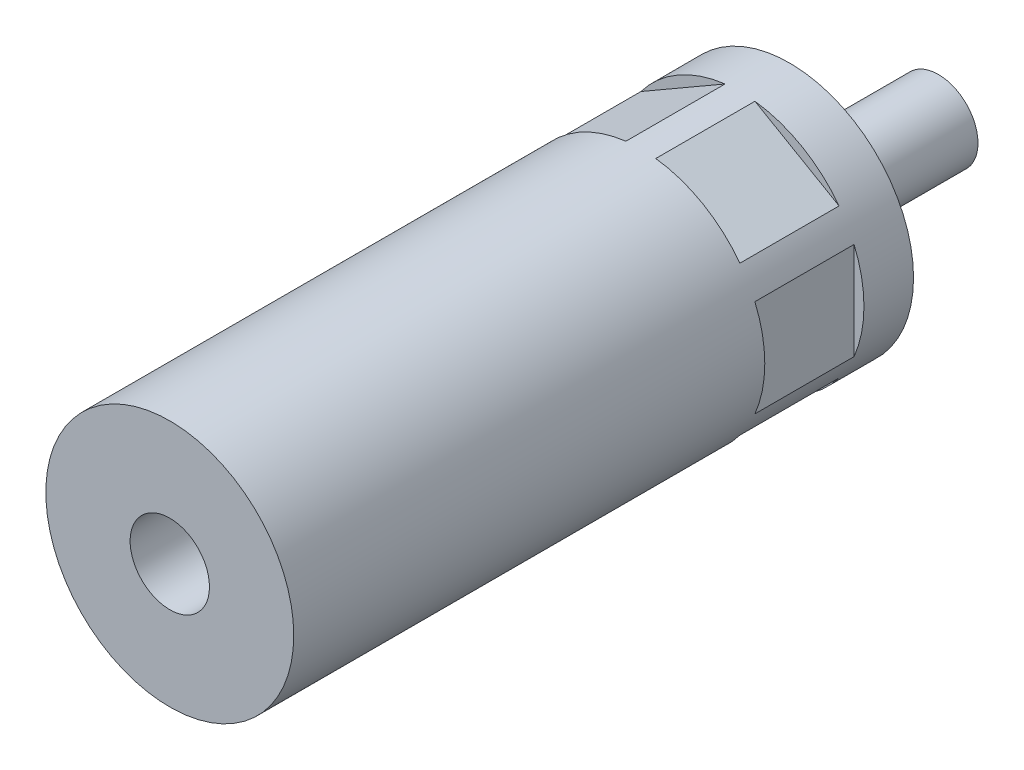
ISO-10303-21;
HEADER;
FILE_DESCRIPTION(('STEP AP214'),'2;1');
FILE_NAME('part.step','',(''),(''),'','','');
FILE_SCHEMA(('AUTOMOTIVE_DESIGN { 1 0 10303 214 1 1 1 1 }'));
ENDSEC;
DATA;
#1=APPLICATION_CONTEXT('core data for automotive mechanical design processes');
#2=APPLICATION_PROTOCOL_DEFINITION('international standard','automotive_design',2000,#1);
#3=PRODUCT_CONTEXT('',#1,'mechanical');
#4=PRODUCT('Part','Part','',(#3));
#5=PRODUCT_RELATED_PRODUCT_CATEGORY('part','',(#4));
#6=PRODUCT_DEFINITION_FORMATION('','',#4);
#7=PRODUCT_DEFINITION_CONTEXT('part definition',#1,'design');
#8=PRODUCT_DEFINITION('design','',#6,#7);
#9=PRODUCT_DEFINITION_SHAPE('','',#8);
#10=(LENGTH_UNIT() NAMED_UNIT(*) SI_UNIT(.MILLI.,.METRE.));
#11=(NAMED_UNIT(*) PLANE_ANGLE_UNIT() SI_UNIT($,.RADIAN.));
#12=(NAMED_UNIT(*) SI_UNIT($,.STERADIAN.) SOLID_ANGLE_UNIT());
#13=UNCERTAINTY_MEASURE_WITH_UNIT(LENGTH_MEASURE(1.E-05),#10,'distance_accuracy_value','');
#14=(GEOMETRIC_REPRESENTATION_CONTEXT(3) GLOBAL_UNCERTAINTY_ASSIGNED_CONTEXT((#13)) GLOBAL_UNIT_ASSIGNED_CONTEXT((#10,
#11,#12)) REPRESENTATION_CONTEXT('',''));
#15=CARTESIAN_POINT('',(0.,0.,0.));
#16=DIRECTION('',(0.,0.,1.));
#17=DIRECTION('',(1.,0.,0.));
#18=AXIS2_PLACEMENT_3D('',#15,#16,#17);
#19=CARTESIAN_POINT('',(0.,0.,80.));
#20=DIRECTION('',(0.,0.,1.));
#21=DIRECTION('',(1.,0.,0.));
#22=AXIS2_PLACEMENT_3D('',#19,#20,#21);
#23=CYLINDRICAL_SURFACE('',#22,25.);
#24=CARTESIAN_POINT('',(0.,0.,10.));
#25=DIRECTION('',(0.,0.,1.));
#26=DIRECTION('',(1.,0.,0.));
#27=AXIS2_PLACEMENT_3D('',#24,#25,#26);
#28=CIRCLE('',#27,25.);
#29=CARTESIAN_POINT('',(-19.9852813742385,-15.0196048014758,10.));
#30=VERTEX_POINT('',#29);
#31=CARTESIAN_POINT('',(-3.0147186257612,-24.8175637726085,10.));
#32=VERTEX_POINT('',#31);
#33=EDGE_CURVE('E152',#30,#32,#28,.T.);
#34=ORIENTED_EDGE('',*,*,#33,.F.);
#35=DIRECTION('',(0.,0.,1.));
#36=VECTOR('',#35,1.);
#37=CARTESIAN_POINT('',(-19.9852813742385,-15.0196048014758,80.));
#38=LINE('',#37,#36);
#39=CARTESIAN_POINT('',(-19.9852813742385,-15.0196048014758,30.));
#40=VERTEX_POINT('',#39);
#41=EDGE_CURVE('E9',#30,#40,#38,.T.);
#42=ORIENTED_EDGE('',*,*,#41,.T.);
#43=CARTESIAN_POINT('',(0.,0.,30.));
#44=DIRECTION('',(0.,0.,1.));
#45=DIRECTION('',(1.,0.,0.));
#46=AXIS2_PLACEMENT_3D('',#43,#44,#45);
#47=CIRCLE('',#46,25.);
#48=CARTESIAN_POINT('',(-3.0147186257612,-24.8175637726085,30.));
#49=VERTEX_POINT('',#48);
#50=EDGE_CURVE('E22',#40,#49,#47,.T.);
#51=ORIENTED_EDGE('',*,*,#50,.T.);
#52=DIRECTION('',(0.,0.,1.));
#53=VECTOR('',#52,1.);
#54=CARTESIAN_POINT('',(-3.0147186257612,-24.8175637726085,80.));
#55=LINE('',#54,#53);
#56=EDGE_CURVE('E149',#49,#32,#55,.F.);
#57=ORIENTED_EDGE('',*,*,#56,.T.);
#58=EDGE_LOOP('',(#34,#42,#51,#57));
#59=FACE_BOUND('',#58,.T.);
#60=DIRECTION('',(0.,0.,1.));
#61=VECTOR('',#60,1.);
#62=CARTESIAN_POINT('',(23.,9.79795897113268,80.));
#63=LINE('',#62,#61);
#64=CARTESIAN_POINT('',(23.,9.79795897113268,10.));
#65=VERTEX_POINT('',#64);
#66=CARTESIAN_POINT('',(23.,9.79795897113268,30.));
#67=VERTEX_POINT('',#66);
#68=EDGE_CURVE('E142',#65,#67,#63,.T.);
#69=ORIENTED_EDGE('',*,*,#68,.F.);
#70=CARTESIAN_POINT('',(23.,-9.7979589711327,10.));
#71=VERTEX_POINT('',#70);
#72=EDGE_CURVE('E141',#71,#65,#28,.T.);
#73=ORIENTED_EDGE('',*,*,#72,.F.);
#74=DIRECTION('',(0.,0.,1.));
#75=VECTOR('',#74,1.);
#76=CARTESIAN_POINT('',(23.,-9.7979589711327,80.));
#77=LINE('',#76,#75);
#78=CARTESIAN_POINT('',(23.,-9.7979589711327,30.));
#79=VERTEX_POINT('',#78);
#80=EDGE_CURVE('E138',#79,#71,#77,.F.);
#81=ORIENTED_EDGE('',*,*,#80,.F.);
#82=EDGE_CURVE('E145',#79,#67,#47,.T.);
#83=ORIENTED_EDGE('',*,*,#82,.T.);
#84=EDGE_LOOP('',(#69,#73,#81,#83));
#85=FACE_BOUND('',#84,.T.);
#86=CARTESIAN_POINT('',(19.9852813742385,15.0196048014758,10.));
#87=VERTEX_POINT('',#86);
#88=CARTESIAN_POINT('',(3.0147186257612,24.8175637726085,10.));
#89=VERTEX_POINT('',#88);
#90=EDGE_CURVE('E134',#87,#89,#28,.T.);
#91=ORIENTED_EDGE('',*,*,#90,.F.);
#92=DIRECTION('',(0.,0.,1.));
#93=VECTOR('',#92,1.);
#94=CARTESIAN_POINT('',(19.9852813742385,15.0196048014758,80.));
#95=LINE('',#94,#93);
#96=CARTESIAN_POINT('',(19.9852813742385,15.0196048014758,30.));
#97=VERTEX_POINT('',#96);
#98=EDGE_CURVE('E135',#87,#97,#95,.T.);
#99=ORIENTED_EDGE('',*,*,#98,.T.);
#100=CARTESIAN_POINT('',(3.0147186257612,24.8175637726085,30.));
#101=VERTEX_POINT('',#100);
#102=EDGE_CURVE('E139',#97,#101,#47,.T.);
#103=ORIENTED_EDGE('',*,*,#102,.T.);
#104=DIRECTION('',(0.,0.,1.));
#105=VECTOR('',#104,1.);
#106=CARTESIAN_POINT('',(3.0147186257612,24.8175637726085,80.));
#107=LINE('',#106,#105);
#108=EDGE_CURVE('E131',#101,#89,#107,.F.);
#109=ORIENTED_EDGE('',*,*,#108,.T.);
#110=EDGE_LOOP('',(#91,#99,#103,#109));
#111=FACE_BOUND('',#110,.T.);
#112=CARTESIAN_POINT('',(0.,0.,0.));
#113=DIRECTION('',(0.,0.,1.));
#114=DIRECTION('',(1.,0.,0.));
#115=AXIS2_PLACEMENT_3D('',#112,#113,#114);
#116=CIRCLE('',#115,25.);
#117=CARTESIAN_POINT('',(25.,0.,0.));
#118=VERTEX_POINT('',#117);
#119=EDGE_CURVE('E210',#118,#118,#116,.T.);
#120=ORIENTED_EDGE('',*,*,#119,.T.);
#121=EDGE_LOOP('',(#120));
#122=FACE_BOUND('',#121,.T.);
#123=CARTESIAN_POINT('',(0.,0.,125.));
#124=DIRECTION('',(0.,0.,1.));
#125=DIRECTION('',(1.,0.,0.));
#126=AXIS2_PLACEMENT_3D('',#123,#124,#125);
#127=CIRCLE('',#126,25.);
#128=CARTESIAN_POINT('',(25.,0.,125.));
#129=VERTEX_POINT('',#128);
#130=EDGE_CURVE('E213',#129,#129,#127,.T.);
#131=ORIENTED_EDGE('',*,*,#130,.F.);
#132=EDGE_LOOP('',(#131));
#133=FACE_BOUND('',#132,.T.);
#134=CARTESIAN_POINT('',(-23.,9.79795897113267,10.));
#135=VERTEX_POINT('',#134);
#136=CARTESIAN_POINT('',(-23.,-9.79795897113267,10.));
#137=VERTEX_POINT('',#136);
#138=EDGE_CURVE('E111',#135,#137,#28,.T.);
#139=ORIENTED_EDGE('',*,*,#138,.F.);
#140=DIRECTION('',(0.,0.,1.));
#141=VECTOR('',#140,1.);
#142=CARTESIAN_POINT('',(-23.,9.79795897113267,80.));
#143=LINE('',#142,#141);
#144=CARTESIAN_POINT('',(-23.,9.79795897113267,30.));
#145=VERTEX_POINT('',#144);
#146=EDGE_CURVE('E110',#135,#145,#143,.T.);
#147=ORIENTED_EDGE('',*,*,#146,.T.);
#148=CARTESIAN_POINT('',(-23.,-9.79795897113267,30.));
#149=VERTEX_POINT('',#148);
#150=EDGE_CURVE('E103',#145,#149,#47,.T.);
#151=ORIENTED_EDGE('',*,*,#150,.T.);
#152=DIRECTION('',(0.,0.,1.));
#153=VECTOR('',#152,1.);
#154=CARTESIAN_POINT('',(-23.,-9.79795897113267,80.));
#155=LINE('',#154,#153);
#156=EDGE_CURVE('E117',#149,#137,#155,.F.);
#157=ORIENTED_EDGE('',*,*,#156,.T.);
#158=EDGE_LOOP('',(#139,#147,#151,#157));
#159=FACE_BOUND('',#158,.T.);
#160=DIRECTION('',(0.,0.,1.));
#161=VECTOR('',#160,1.);
#162=CARTESIAN_POINT('',(-19.9852813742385,15.0196048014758,80.));
#163=LINE('',#162,#161);
#164=CARTESIAN_POINT('',(-19.9852813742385,15.0196048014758,10.));
#165=VERTEX_POINT('',#164);
#166=CARTESIAN_POINT('',(-19.9852813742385,15.0196048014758,30.));
#167=VERTEX_POINT('',#166);
#168=EDGE_CURVE('E129',#165,#167,#163,.T.);
#169=ORIENTED_EDGE('',*,*,#168,.F.);
#170=CARTESIAN_POINT('',(-3.0147186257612,24.8175637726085,10.));
#171=VERTEX_POINT('',#170);
#172=EDGE_CURVE('E125',#171,#165,#28,.T.);
#173=ORIENTED_EDGE('',*,*,#172,.F.);
#174=DIRECTION('',(0.,0.,1.));
#175=VECTOR('',#174,1.);
#176=CARTESIAN_POINT('',(-3.01471862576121,24.8175637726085,80.));
#177=LINE('',#176,#175);
#178=CARTESIAN_POINT('',(-3.01471862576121,24.8175637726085,30.));
#179=VERTEX_POINT('',#178);
#180=EDGE_CURVE('E123',#179,#171,#177,.F.);
#181=ORIENTED_EDGE('',*,*,#180,.F.);
#182=EDGE_CURVE('E113',#179,#167,#47,.T.);
#183=ORIENTED_EDGE('',*,*,#182,.T.);
#184=EDGE_LOOP('',(#169,#173,#181,#183));
#185=FACE_BOUND('',#184,.T.);
#186=DIRECTION('',(0.,0.,1.));
#187=VECTOR('',#186,1.);
#188=CARTESIAN_POINT('',(19.9852813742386,-15.0196048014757,80.));
#189=LINE('',#188,#187);
#190=CARTESIAN_POINT('',(19.9852813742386,-15.0196048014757,10.));
#191=VERTEX_POINT('',#190);
#192=CARTESIAN_POINT('',(19.9852813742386,-15.0196048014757,30.));
#193=VERTEX_POINT('',#192);
#194=EDGE_CURVE('E148',#191,#193,#189,.T.);
#195=ORIENTED_EDGE('',*,*,#194,.F.);
#196=CARTESIAN_POINT('',(3.0147186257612,-24.8175637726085,10.));
#197=VERTEX_POINT('',#196);
#198=EDGE_CURVE('E147',#197,#191,#28,.T.);
#199=ORIENTED_EDGE('',*,*,#198,.F.);
#200=DIRECTION('',(0.,0.,1.));
#201=VECTOR('',#200,1.);
#202=CARTESIAN_POINT('',(3.0147186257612,-24.8175637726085,80.));
#203=LINE('',#202,#201);
#204=CARTESIAN_POINT('',(3.0147186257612,-24.8175637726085,30.));
#205=VERTEX_POINT('',#204);
#206=EDGE_CURVE('E144',#205,#197,#203,.F.);
#207=ORIENTED_EDGE('',*,*,#206,.F.);
#208=EDGE_CURVE('E150',#205,#193,#47,.T.);
#209=ORIENTED_EDGE('',*,*,#208,.T.);
#210=EDGE_LOOP('',(#195,#199,#207,#209));
#211=FACE_BOUND('',#210,.T.);
#212=ADVANCED_FACE('F14',(#59,#85,#111,#122,#133,#159,#185,#211),#23,.T.);
#213=CARTESIAN_POINT('',(0.,0.,-30.));
#214=DIRECTION('',(0.,0.,1.));
#215=DIRECTION('',(1.,0.,0.));
#216=AXIS2_PLACEMENT_3D('',#213,#214,#215);
#217=PLANE('',#216);
#218=CARTESIAN_POINT('',(0.,0.,-30.));
#219=DIRECTION('',(0.,0.,1.));
#220=DIRECTION('',(1.,0.,0.));
#221=AXIS2_PLACEMENT_3D('',#218,#219,#220);
#222=CIRCLE('',#221,8.);
#223=CARTESIAN_POINT('',(8.,0.,-30.));
#224=VERTEX_POINT('',#223);
#225=EDGE_CURVE('E190',#224,#224,#222,.T.);
#226=ORIENTED_EDGE('',*,*,#225,.F.);
#227=EDGE_LOOP('',(#226));
#228=FACE_BOUND('',#227,.T.);
#229=ADVANCED_FACE('F16',(#228),#217,.F.);
#230=CARTESIAN_POINT('',(0.,0.,80.));
#231=DIRECTION('',(0.,0.,1.));
#232=DIRECTION('',(1.,0.,0.));
#233=AXIS2_PLACEMENT_3D('',#230,#231,#232);
#234=CYLINDRICAL_SURFACE('',#233,8.);
#235=CARTESIAN_POINT('',(0.,0.,90.));
#236=DIRECTION('',(0.,0.,1.));
#237=DIRECTION('',(1.,0.,0.));
#238=AXIS2_PLACEMENT_3D('',#235,#236,#237);
#239=CIRCLE('',#238,8.);
#240=CARTESIAN_POINT('',(8.,0.,90.));
#241=VERTEX_POINT('',#240);
#242=EDGE_CURVE('E245',#241,#241,#239,.T.);
#243=ORIENTED_EDGE('',*,*,#242,.F.);
#244=EDGE_LOOP('',(#243));
#245=FACE_BOUND('',#244,.T.);
#246=CARTESIAN_POINT('',(0.,0.,125.));
#247=DIRECTION('',(0.,0.,1.));
#248=DIRECTION('',(1.,0.,0.));
#249=AXIS2_PLACEMENT_3D('',#246,#247,#248);
#250=CIRCLE('',#249,8.);
#251=CARTESIAN_POINT('',(8.,0.,125.));
#252=VERTEX_POINT('',#251);
#253=EDGE_CURVE('E159',#252,#252,#250,.T.);
#254=ORIENTED_EDGE('',*,*,#253,.T.);
#255=EDGE_LOOP('',(#254));
#256=FACE_BOUND('',#255,.T.);
#257=ADVANCED_FACE('F219',(#245,#256),#234,.F.);
#258=CARTESIAN_POINT('',(25.,0.,125.));
#259=DIRECTION('',(0.,0.,-1.));
#260=DIRECTION('',(-1.,0.,0.));
#261=AXIS2_PLACEMENT_3D('',#258,#259,#260);
#262=PLANE('',#261);
#263=ORIENTED_EDGE('',*,*,#253,.F.);
#264=EDGE_LOOP('',(#263));
#265=FACE_BOUND('',#264,.T.);
#266=ORIENTED_EDGE('',*,*,#130,.T.);
#267=EDGE_LOOP('',(#266));
#268=FACE_BOUND('',#267,.T.);
#269=ADVANCED_FACE('F221',(#265,#268),#262,.F.);
#270=CARTESIAN_POINT('',(25.,0.,0.));
#271=DIRECTION('',(0.,0.,-1.));
#272=DIRECTION('',(-1.,0.,0.));
#273=AXIS2_PLACEMENT_3D('',#270,#271,#272);
#274=PLANE('',#273);
#275=CARTESIAN_POINT('',(0.,0.,0.));
#276=DIRECTION('',(0.,0.,1.));
#277=DIRECTION('',(1.,0.,0.));
#278=AXIS2_PLACEMENT_3D('',#275,#276,#277);
#279=CIRCLE('',#278,6.5);
#280=CARTESIAN_POINT('',(6.5,0.,0.));
#281=VERTEX_POINT('',#280);
#282=EDGE_CURVE('E207',#281,#281,#279,.T.);
#283=ORIENTED_EDGE('',*,*,#282,.T.);
#284=EDGE_LOOP('',(#283));
#285=FACE_BOUND('',#284,.T.);
#286=ORIENTED_EDGE('',*,*,#119,.F.);
#287=EDGE_LOOP('',(#286));
#288=FACE_BOUND('',#287,.T.);
#289=ADVANCED_FACE('F224',(#285,#288),#274,.T.);
#290=CARTESIAN_POINT('',(0.,0.,80.));
#291=DIRECTION('',(0.,0.,1.));
#292=DIRECTION('',(1.,0.,0.));
#293=AXIS2_PLACEMENT_3D('',#290,#291,#292);
#294=CYLINDRICAL_SURFACE('',#293,6.5);
#295=CARTESIAN_POINT('',(0.,0.,-4.));
#296=DIRECTION('',(0.,0.,1.));
#297=DIRECTION('',(1.,0.,0.));
#298=AXIS2_PLACEMENT_3D('',#295,#296,#297);
#299=CIRCLE('',#298,6.5);
#300=CARTESIAN_POINT('',(6.5,0.,-4.));
#301=VERTEX_POINT('',#300);
#302=EDGE_CURVE('E204',#301,#301,#299,.T.);
#303=ORIENTED_EDGE('',*,*,#302,.T.);
#304=EDGE_LOOP('',(#303));
#305=FACE_BOUND('',#304,.T.);
#306=ORIENTED_EDGE('',*,*,#282,.F.);
#307=EDGE_LOOP('',(#306));
#308=FACE_BOUND('',#307,.T.);
#309=ADVANCED_FACE('F443',(#305,#308),#294,.T.);
#310=CARTESIAN_POINT('',(6.5,0.,-4.));
#311=DIRECTION('',(0.,0.,1.));
#312=DIRECTION('',(1.,0.,0.));
#313=AXIS2_PLACEMENT_3D('',#310,#311,#312);
#314=PLANE('',#313);
#315=CARTESIAN_POINT('',(0.,0.,-4.));
#316=DIRECTION('',(0.,0.,1.));
#317=DIRECTION('',(1.,0.,0.));
#318=AXIS2_PLACEMENT_3D('',#315,#316,#317);
#319=CIRCLE('',#318,8.);
#320=CARTESIAN_POINT('',(8.,0.,-4.));
#321=VERTEX_POINT('',#320);
#322=EDGE_CURVE('E201',#321,#321,#319,.T.);
#323=ORIENTED_EDGE('',*,*,#322,.T.);
#324=EDGE_LOOP('',(#323));
#325=FACE_BOUND('',#324,.T.);
#326=ORIENTED_EDGE('',*,*,#302,.F.);
#327=EDGE_LOOP('',(#326));
#328=FACE_BOUND('',#327,.T.);
#329=ADVANCED_FACE('F339',(#325,#328),#314,.T.);
#330=CARTESIAN_POINT('',(0.,0.,80.));
#331=DIRECTION('',(0.,0.,1.));
#332=DIRECTION('',(1.,0.,0.));
#333=AXIS2_PLACEMENT_3D('',#330,#331,#332);
#334=CYLINDRICAL_SURFACE('',#333,8.);
#335=ORIENTED_EDGE('',*,*,#322,.F.);
#336=EDGE_LOOP('',(#335));
#337=FACE_BOUND('',#336,.T.);
#338=ORIENTED_EDGE('',*,*,#225,.T.);
#339=EDGE_LOOP('',(#338));
#340=FACE_BOUND('',#339,.T.);
#341=ADVANCED_FACE('F333',(#337,#340),#334,.T.);
#342=CARTESIAN_POINT('',(-23.,13.2790561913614,30.));
#343=DIRECTION('',(1.,0.,0.));
#344=DIRECTION('',(0.,1.,0.));
#345=AXIS2_PLACEMENT_3D('',#342,#343,#344);
#346=PLANE('',#345);
#347=DIRECTION('',(0.,-1.,0.));
#348=VECTOR('',#347,1.);
#349=CARTESIAN_POINT('',(-23.,13.2790561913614,10.));
#350=LINE('',#349,#348);
#351=EDGE_CURVE('E247',#135,#137,#350,.T.);
#352=ORIENTED_EDGE('',*,*,#351,.T.);
#353=ORIENTED_EDGE('',*,*,#156,.F.);
#354=DIRECTION('',(0.,-1.,0.));
#355=VECTOR('',#354,1.);
#356=CARTESIAN_POINT('',(-23.,13.2790561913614,30.));
#357=LINE('',#356,#355);
#358=EDGE_CURVE('E106',#145,#149,#357,.T.);
#359=ORIENTED_EDGE('',*,*,#358,.F.);
#360=ORIENTED_EDGE('',*,*,#146,.F.);
#361=EDGE_LOOP('',(#352,#353,#359,#360));
#362=FACE_BOUND('',#361,.T.);
#363=ADVANCED_FACE('F115',(#362),#346,.F.);
#364=CARTESIAN_POINT('',(0.,0.,10.));
#365=DIRECTION('',(0.,0.,1.));
#366=DIRECTION('',(1.,0.,0.));
#367=AXIS2_PLACEMENT_3D('',#364,#365,#366);
#368=PLANE('',#367);
#369=ORIENTED_EDGE('',*,*,#138,.T.);
#370=ORIENTED_EDGE('',*,*,#351,.F.);
#371=EDGE_LOOP('',(#369,#370));
#372=FACE_BOUND('',#371,.T.);
#373=ADVANCED_FACE('F281',(#372),#368,.T.);
#374=CARTESIAN_POINT('',(0.,0.,30.));
#375=DIRECTION('',(0.,0.,1.));
#376=DIRECTION('',(1.,0.,0.));
#377=AXIS2_PLACEMENT_3D('',#374,#375,#376);
#378=PLANE('',#377);
#379=ORIENTED_EDGE('',*,*,#358,.T.);
#380=ORIENTED_EDGE('',*,*,#150,.F.);
#381=EDGE_LOOP('',(#379,#380));
#382=FACE_BOUND('',#381,.T.);
#383=ADVANCED_FACE('F105',(#382),#378,.F.);
#384=CARTESIAN_POINT('',(-23.,13.2790561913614,30.));
#385=DIRECTION('',(-0.5,0.866025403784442,0.));
#386=DIRECTION('',(-0.866025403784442,-0.5,0.));
#387=AXIS2_PLACEMENT_3D('',#384,#385,#386);
#388=PLANE('',#387);
#389=ORIENTED_EDGE('',*,*,#168,.T.);
#390=DIRECTION('',(0.866025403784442,0.5,0.));
#391=VECTOR('',#390,1.);
#392=CARTESIAN_POINT('',(-23.,13.2790561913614,30.));
#393=LINE('',#392,#391);
#394=EDGE_CURVE('E118',#167,#179,#393,.T.);
#395=ORIENTED_EDGE('',*,*,#394,.T.);
#396=ORIENTED_EDGE('',*,*,#180,.T.);
#397=DIRECTION('',(0.866025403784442,0.5,0.));
#398=VECTOR('',#397,1.);
#399=CARTESIAN_POINT('',(-23.,13.2790561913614,10.));
#400=LINE('',#399,#398);
#401=EDGE_CURVE('E249',#165,#171,#400,.T.);
#402=ORIENTED_EDGE('',*,*,#401,.F.);
#403=EDGE_LOOP('',(#389,#395,#396,#402));
#404=FACE_BOUND('',#403,.T.);
#405=ADVANCED_FACE('F265',(#404),#388,.T.);
#406=ORIENTED_EDGE('',*,*,#172,.T.);
#407=ORIENTED_EDGE('',*,*,#401,.T.);
#408=EDGE_LOOP('',(#406,#407));
#409=FACE_BOUND('',#408,.T.);
#410=ADVANCED_FACE('F259',(#409),#368,.T.);
#411=ORIENTED_EDGE('',*,*,#394,.F.);
#412=ORIENTED_EDGE('',*,*,#182,.F.);
#413=EDGE_LOOP('',(#411,#412));
#414=FACE_BOUND('',#413,.T.);
#415=ADVANCED_FACE('F267',(#414),#378,.F.);
#416=CARTESIAN_POINT('',(23.,13.2790561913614,30.));
#417=DIRECTION('',(-0.499999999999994,-0.866025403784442,0.));
#418=DIRECTION('',(0.866025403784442,-0.499999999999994,0.));
#419=AXIS2_PLACEMENT_3D('',#416,#417,#418);
#420=PLANE('',#419);
#421=DIRECTION('',(-0.866025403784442,0.499999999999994,0.));
#422=VECTOR('',#421,1.);
#423=CARTESIAN_POINT('',(23.,13.2790561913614,10.));
#424=LINE('',#423,#422);
#425=EDGE_CURVE('E257',#87,#89,#424,.T.);
#426=ORIENTED_EDGE('',*,*,#425,.T.);
#427=ORIENTED_EDGE('',*,*,#108,.F.);
#428=DIRECTION('',(-0.866025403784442,0.499999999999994,0.));
#429=VECTOR('',#428,1.);
#430=CARTESIAN_POINT('',(23.,13.2790561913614,30.));
#431=LINE('',#430,#429);
#432=EDGE_CURVE('E192',#97,#101,#431,.T.);
#433=ORIENTED_EDGE('',*,*,#432,.F.);
#434=ORIENTED_EDGE('',*,*,#98,.F.);
#435=EDGE_LOOP('',(#426,#427,#433,#434));
#436=FACE_BOUND('',#435,.T.);
#437=ADVANCED_FACE('F269',(#436),#420,.F.);
#438=ORIENTED_EDGE('',*,*,#90,.T.);
#439=ORIENTED_EDGE('',*,*,#425,.F.);
#440=EDGE_LOOP('',(#438,#439));
#441=FACE_BOUND('',#440,.T.);
#442=ADVANCED_FACE('F277',(#441),#368,.T.);
#443=ORIENTED_EDGE('',*,*,#432,.T.);
#444=ORIENTED_EDGE('',*,*,#102,.F.);
#445=EDGE_LOOP('',(#443,#444));
#446=FACE_BOUND('',#445,.T.);
#447=ADVANCED_FACE('F271',(#446),#378,.F.);
#448=CARTESIAN_POINT('',(23.,13.2790561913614,30.));
#449=DIRECTION('',(1.,0.,0.));
#450=DIRECTION('',(0.,1.,0.));
#451=AXIS2_PLACEMENT_3D('',#448,#449,#450);
#452=PLANE('',#451);
#453=ORIENTED_EDGE('',*,*,#68,.T.);
#454=DIRECTION('',(0.,-1.,0.));
#455=VECTOR('',#454,1.);
#456=CARTESIAN_POINT('',(23.,13.2790561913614,30.));
#457=LINE('',#456,#455);
#458=EDGE_CURVE('E187',#67,#79,#457,.T.);
#459=ORIENTED_EDGE('',*,*,#458,.T.);
#460=ORIENTED_EDGE('',*,*,#80,.T.);
#461=DIRECTION('',(0.,-1.,0.));
#462=VECTOR('',#461,1.);
#463=CARTESIAN_POINT('',(23.,13.2790561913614,10.));
#464=LINE('',#463,#462);
#465=EDGE_CURVE('E256',#65,#71,#464,.T.);
#466=ORIENTED_EDGE('',*,*,#465,.F.);
#467=EDGE_LOOP('',(#453,#459,#460,#466));
#468=FACE_BOUND('',#467,.T.);
#469=ADVANCED_FACE('F286',(#468),#452,.T.);
#470=ORIENTED_EDGE('',*,*,#72,.T.);
#471=ORIENTED_EDGE('',*,*,#465,.T.);
#472=EDGE_LOOP('',(#470,#471));
#473=FACE_BOUND('',#472,.T.);
#474=ADVANCED_FACE('F294',(#473),#368,.T.);
#475=ORIENTED_EDGE('',*,*,#458,.F.);
#476=ORIENTED_EDGE('',*,*,#82,.F.);
#477=EDGE_LOOP('',(#475,#476));
#478=FACE_BOUND('',#477,.T.);
#479=ADVANCED_FACE('F288',(#478),#378,.F.);
#480=CARTESIAN_POINT('',(23.,-13.2790561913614,30.));
#481=DIRECTION('',(0.5,-0.866025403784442,0.));
#482=DIRECTION('',(0.866025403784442,0.5,0.));
#483=AXIS2_PLACEMENT_3D('',#480,#481,#482);
#484=PLANE('',#483);
#485=ORIENTED_EDGE('',*,*,#194,.T.);
#486=DIRECTION('',(-0.866025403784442,-0.5,0.));
#487=VECTOR('',#486,1.);
#488=CARTESIAN_POINT('',(23.,-13.2790561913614,30.));
#489=LINE('',#488,#487);
#490=EDGE_CURVE('E37',#193,#205,#489,.T.);
#491=ORIENTED_EDGE('',*,*,#490,.T.);
#492=ORIENTED_EDGE('',*,*,#206,.T.);
#493=DIRECTION('',(-0.866025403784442,-0.5,0.));
#494=VECTOR('',#493,1.);
#495=CARTESIAN_POINT('',(23.,-13.2790561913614,10.));
#496=LINE('',#495,#494);
#497=EDGE_CURVE('E253',#191,#197,#496,.T.);
#498=ORIENTED_EDGE('',*,*,#497,.F.);
#499=EDGE_LOOP('',(#485,#491,#492,#498));
#500=FACE_BOUND('',#499,.T.);
#501=ADVANCED_FACE('F298',(#500),#484,.T.);
#502=ORIENTED_EDGE('',*,*,#198,.T.);
#503=ORIENTED_EDGE('',*,*,#497,.T.);
#504=EDGE_LOOP('',(#502,#503));
#505=FACE_BOUND('',#504,.T.);
#506=ADVANCED_FACE('F305',(#505),#368,.T.);
#507=ORIENTED_EDGE('',*,*,#490,.F.);
#508=ORIENTED_EDGE('',*,*,#208,.F.);
#509=EDGE_LOOP('',(#507,#508));
#510=FACE_BOUND('',#509,.T.);
#511=ADVANCED_FACE('F185',(#510),#378,.F.);
#512=DIRECTION('',(0.866025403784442,-0.5,0.));
#513=VECTOR('',#512,1.);
#514=CARTESIAN_POINT('',(-23.,-13.2790561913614,30.));
#515=LINE('',#514,#513);
#516=EDGE_CURVE('E186',#40,#49,#515,.T.);
#517=ORIENTED_EDGE('',*,*,#516,.T.);
#518=ORIENTED_EDGE('',*,*,#50,.F.);
#519=EDGE_LOOP('',(#517,#518));
#520=FACE_BOUND('',#519,.T.);
#521=ADVANCED_FACE('F284',(#520),#378,.F.);
#522=ORIENTED_EDGE('',*,*,#33,.T.);
#523=DIRECTION('',(0.866025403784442,-0.5,0.));
#524=VECTOR('',#523,1.);
#525=CARTESIAN_POINT('',(-23.,-13.2790561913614,10.));
#526=LINE('',#525,#524);
#527=EDGE_CURVE('E29',#30,#32,#526,.T.);
#528=ORIENTED_EDGE('',*,*,#527,.F.);
#529=EDGE_LOOP('',(#522,#528));
#530=FACE_BOUND('',#529,.T.);
#531=ADVANCED_FACE('F314',(#530),#368,.T.);
#532=CARTESIAN_POINT('',(-23.,-13.2790561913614,30.));
#533=DIRECTION('',(0.5,0.866025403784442,0.));
#534=DIRECTION('',(-0.866025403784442,0.5,0.));
#535=AXIS2_PLACEMENT_3D('',#532,#533,#534);
#536=PLANE('',#535);
#537=ORIENTED_EDGE('',*,*,#527,.T.);
#538=ORIENTED_EDGE('',*,*,#56,.F.);
#539=ORIENTED_EDGE('',*,*,#516,.F.);
#540=ORIENTED_EDGE('',*,*,#41,.F.);
#541=EDGE_LOOP('',(#537,#538,#539,#540));
#542=FACE_BOUND('',#541,.T.);
#543=ADVANCED_FACE('F321',(#542),#536,.F.);
#544=CARTESIAN_POINT('',(0.,0.,90.));
#545=DIRECTION('',(0.,0.,1.));
#546=DIRECTION('',(1.,0.,0.));
#547=AXIS2_PLACEMENT_3D('',#544,#545,#546);
#548=PLANE('',#547);
#549=ORIENTED_EDGE('',*,*,#242,.T.);
#550=EDGE_LOOP('',(#549));
#551=FACE_BOUND('',#550,.T.);
#552=ADVANCED_FACE('F326',(#551),#548,.T.);
#553=CLOSED_SHELL('',(#212,#229,#257,#269,#289,#309,#329,#341,#363,#373,#383,#405,#410,#415,
#437,#442,#447,#469,#474,#479,#501,#506,#511,#521,#531,#543,#552));
#554=MANIFOLD_SOLID_BREP('B1',#553);
#555=ADVANCED_BREP_SHAPE_REPRESENTATION('',(#18,#554),#14);
#556=SHAPE_DEFINITION_REPRESENTATION(#9,#555);
ENDSEC;
END-ISO-10303-21;
